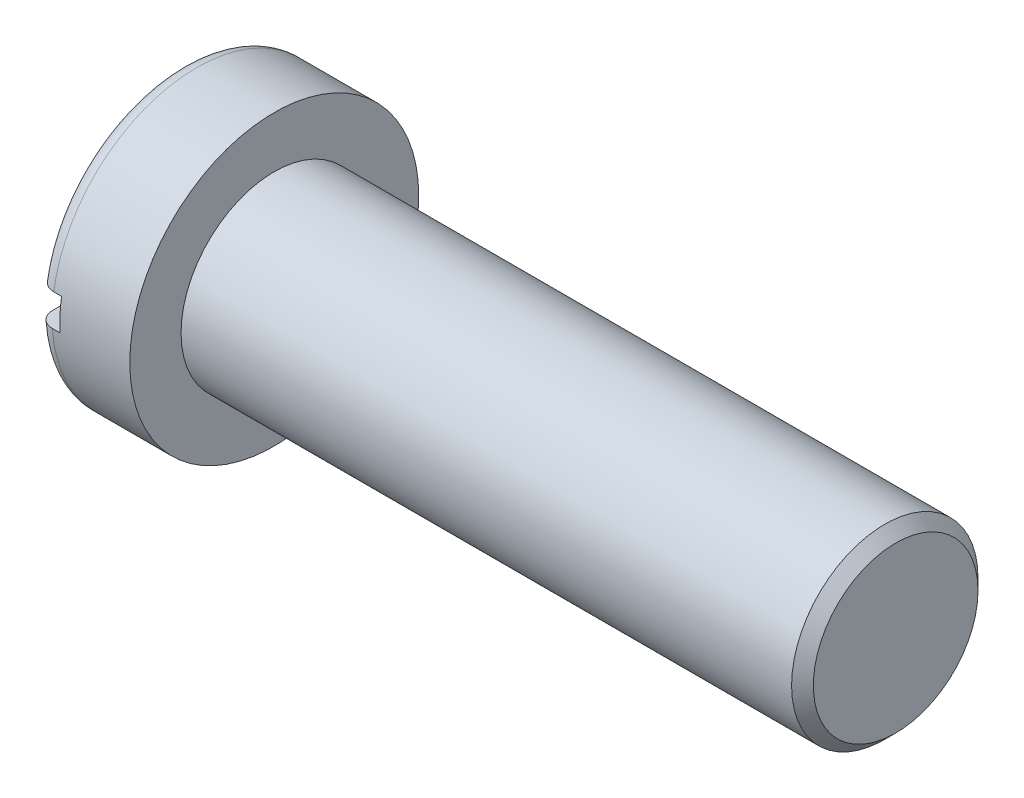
from build123d import *

# Parameters (mm, degrees)
ESQUISSE3_W             = 0.75
ESQUISSE3_H             = 1
COUPER_EXTRUSION1_DEPTH = 5
CONG_1_R                = 0.5
CHANFREIN2_SIZE         = 0.35


with BuildPart() as part:
    # Esquisse1 → Base-R_volution (revolve)
    with BuildSketch(Plane.XY, mode=Mode.PRIVATE) as base_r_volution_sk:
        Polygon((0, 0), (0, 4.65), (3, 4.65), (3, 3), (23, 3), (23, 0), align=None)
    revolve(base_r_volution_sk.sketch.rotate(Axis((0, 0, 0), (1, 0, 0)), 90), axis=Axis((0, 0, 0), (1, 0, 0)))

    # Esquisse3 → Couper-Extrusion1 (cut, symmetric)
    with BuildSketch(Plane.XY):
        with Locations((0.375, 0.2)):
            Rectangle(ESQUISSE3_W, ESQUISSE3_H)
    extrude(amount=COUPER_EXTRUSION1_DEPTH, both=True, mode=Mode.SUBTRACT)

    # Cong_1
    cong_1_edges = [part.edges().sort_by_distance(p)[0] for p in [
        (0, -4.65, 0),
        (0, 4.65, 0),
    ]]
    fillet(cong_1_edges, radius=CONG_1_R)

    # Chanfrein2
    chanfrein2_edges = [part.edges().sort_by_distance(p)[0] for p in [
        (23, 0, -3),
    ]]
    chamfer(chanfrein2_edges, length=CHANFREIN2_SIZE)


solid = part.part
